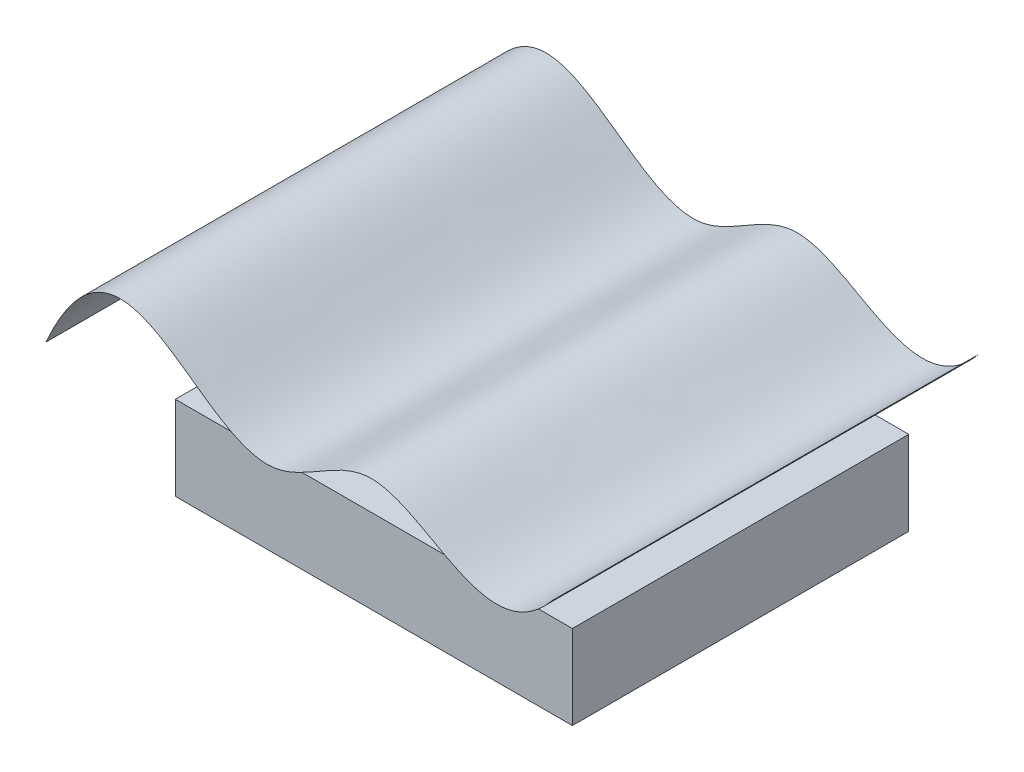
from build123d import *

# Parameters (mm, degrees)
SKETCH1_W           = 189.489814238
SKETCH1_H           = 160.498672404
BOSS_EXTRUDE1_DEPTH = 40.132


with BuildPart() as part:
    # Sketch1 → Boss-Extrude1 (new body)
    with BuildSketch(Plane(origin=(0, 0, 0), x_dir=(1, 0, 0), z_dir=(0, 1, 0))):
        Rectangle(SKETCH1_W, SKETCH1_H)
    extrude(amount=BOSS_EXTRUDE1_DEPTH)


solid = part.part
